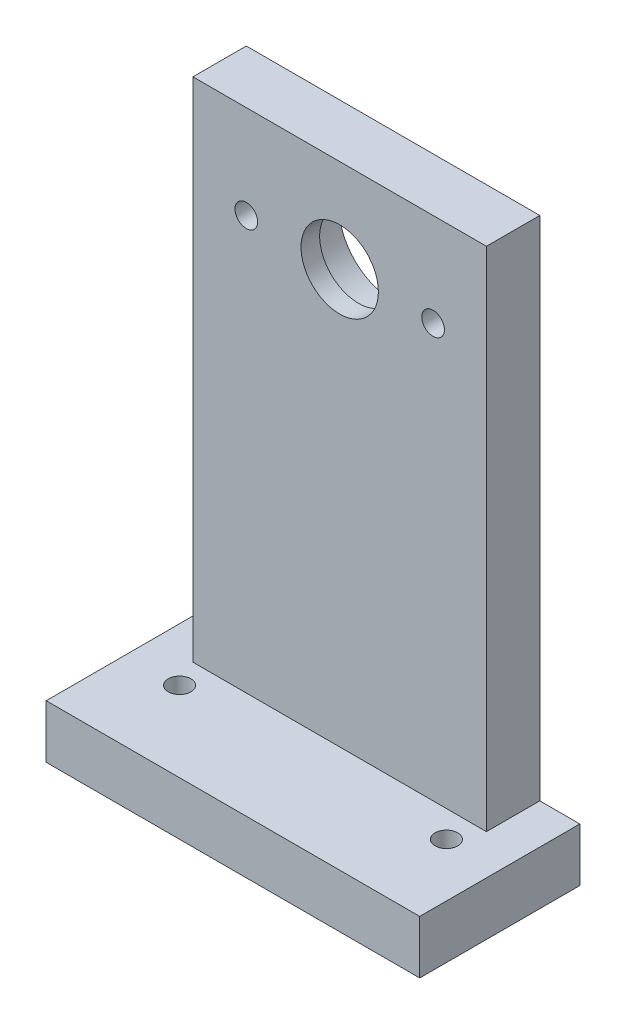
from build123d import *

# Parameters (mm, degrees)
SKETCH_1_W                                   = 56
SKETCH_1_H                                   = 8
FOOT_56X24X8_DEPTH                           = 24
SKETCH_2_W                                   = 44
SKETCH_2_H                                   = 84
TOWER_PIVOT_HEIGHT70_DEPTH                   = 8
SHAFT_ACCESS_AND_RETAINER_M3_DEPTH           = 92.738759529
SHAFT_ACCESS_AND_RETAINER_M3_DEPTH_BACK      = 92.738759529
SKETCH_3_R                                   = 5.8
SKETCH_3_R_2                                 = 1.7
SKETCH_4_R                                   = 8.1
F_625ZZ_POCKET_D16P2_DEPTH5P2_TEST_FIT_DEPTH = 5.2
FOOT_M3_THROUGH_DEPTH                        = 92.738759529
FOOT_M3_THROUGH_DEPTH_BACK                   = 92.738759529
SKETCH_5_R                                   = 1.7


with BuildPart() as part:
    # Sketch 1 → Foot_56x24x8 (new body)
    with BuildSketch(Plane.XY):
        with Locations((0, 4)):
            Rectangle(SKETCH_1_W, SKETCH_1_H)
    extrude(amount=FOOT_56X24X8_DEPTH)

    # Sketch 2 → Tower_pivot_height70 (add)
    with BuildSketch(Plane.XY):
        with Locations((0, 42)):
            Rectangle(SKETCH_2_W, SKETCH_2_H)
    extrude(amount=TOWER_PIVOT_HEIGHT70_DEPTH)

    # Sketch 3 → Shaft_access_and_retainer_M3 (cut, two sides: drawn at the far end of the back side and taken through both)
    with BuildSketch(Plane.XY.offset(-SHAFT_ACCESS_AND_RETAINER_M3_DEPTH_BACK)):
        with Locations((0, 70)):
            Circle(SKETCH_3_R)
        with Locations((-14, 70)):
            Circle(SKETCH_3_R_2)
        with Locations((14, 70)):
            Circle(SKETCH_3_R_2)
    extrude(amount=SHAFT_ACCESS_AND_RETAINER_M3_DEPTH + SHAFT_ACCESS_AND_RETAINER_M3_DEPTH_BACK, mode=Mode.SUBTRACT)

    # Sketch 4 → 625ZZ_pocket_D16p2_depth5p2_TEST_FIT (cut)
    with BuildSketch(Plane.XY):
        with Locations((0, 70)):
            Circle(SKETCH_4_R)
    extrude(amount=F_625ZZ_POCKET_D16P2_DEPTH5P2_TEST_FIT_DEPTH, mode=Mode.SUBTRACT)

    # Sketch 5 → Foot_M3_through (cut, two sides: drawn at the far end of the back side and taken through both)
    with BuildSketch(Plane(origin=(0, 0, 0), x_dir=(1, 0, 0), z_dir=(0, 1, 0)).offset(-FOOT_M3_THROUGH_DEPTH_BACK)):
        with Locations(Location((-20, -12, 0), (0, 0, 270))):
            Circle(SKETCH_5_R)
        with Locations(Location((20, -12, 0), (0, 0, 270))):
            Circle(SKETCH_5_R)
    extrude(amount=FOOT_M3_THROUGH_DEPTH + FOOT_M3_THROUGH_DEPTH_BACK, mode=Mode.SUBTRACT)


solid = part.part
